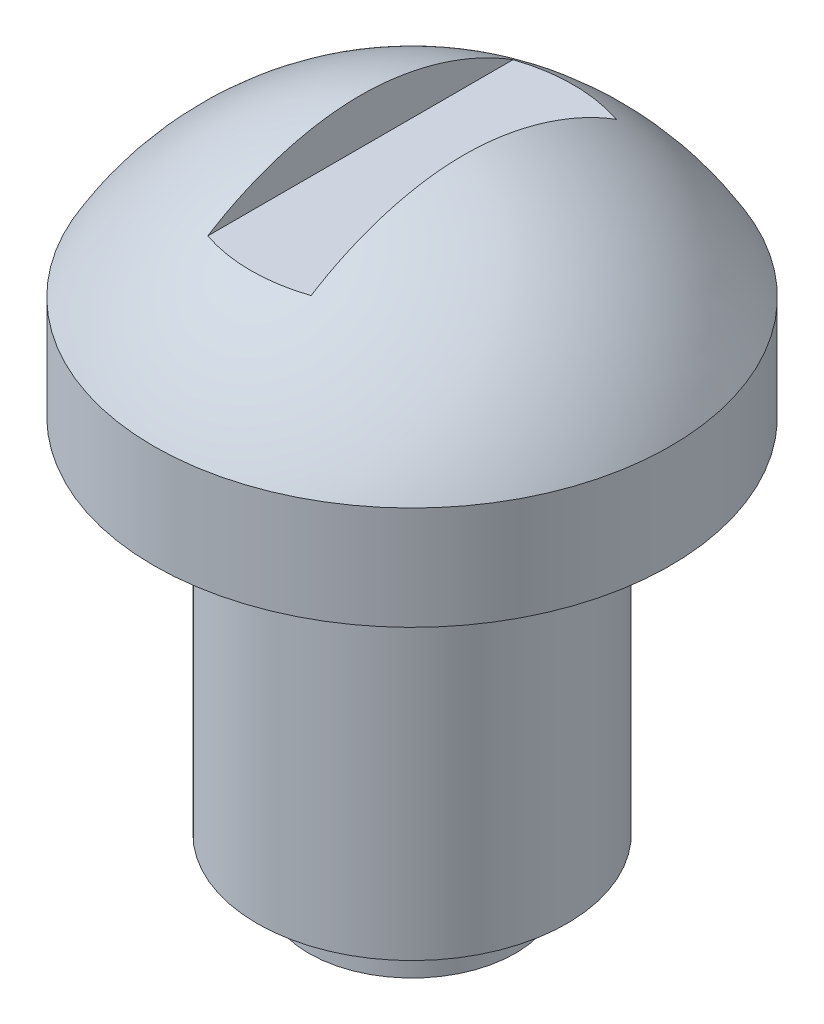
from build123d import *

# Parameters (mm, degrees)
CUT_EXTRUDE1_DEPTH      = 15.798648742
CUT_EXTRUDE1_DEPTH_BACK = 15.798648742
SKETCH7_W               = 2
SKETCH7_H               = 1


with BuildPart() as part:
    # Sketch1 → Revolve1 (revolve)
    with BuildSketch(Plane.XY, mode=Mode.PRIVATE) as revolve1_sk:
        Polygon((0, 0), (2, 0), (2, 1), (3, 1), (3, 8), (5, 8), (5, 10), (0, 10), align=None)
    revolve(revolve1_sk.sketch.rotate(Axis((0, 0, 0), (0, -1, 0)), 90), axis=Axis((0, 0, 0), (0, -1, 0)))

    # Sketch6 → Revolve3 (revolve)
    with BuildSketch(Plane.XY):
        with BuildLine():
            Line((0, 13), (0, 10))
            Line((0, 10), (5, 10))
            ThreePointArc((5, 10), (2.888936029, 12.148226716), (0, 13))
        make_face()
    revolve(axis=Axis((0, 0, 0), (0, 1, 0)))

    # Sketch7 → Cut-Extrude1 (cut, two sides: drawn at the far end of the back side and taken through both)
    with BuildSketch(Plane.XY.offset(-CUT_EXTRUDE1_DEPTH_BACK)):
        with Locations((0, 12.503269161)):
            Rectangle(SKETCH7_W, SKETCH7_H)
    extrude(amount=CUT_EXTRUDE1_DEPTH + CUT_EXTRUDE1_DEPTH_BACK, mode=Mode.SUBTRACT)


solid = part.part
